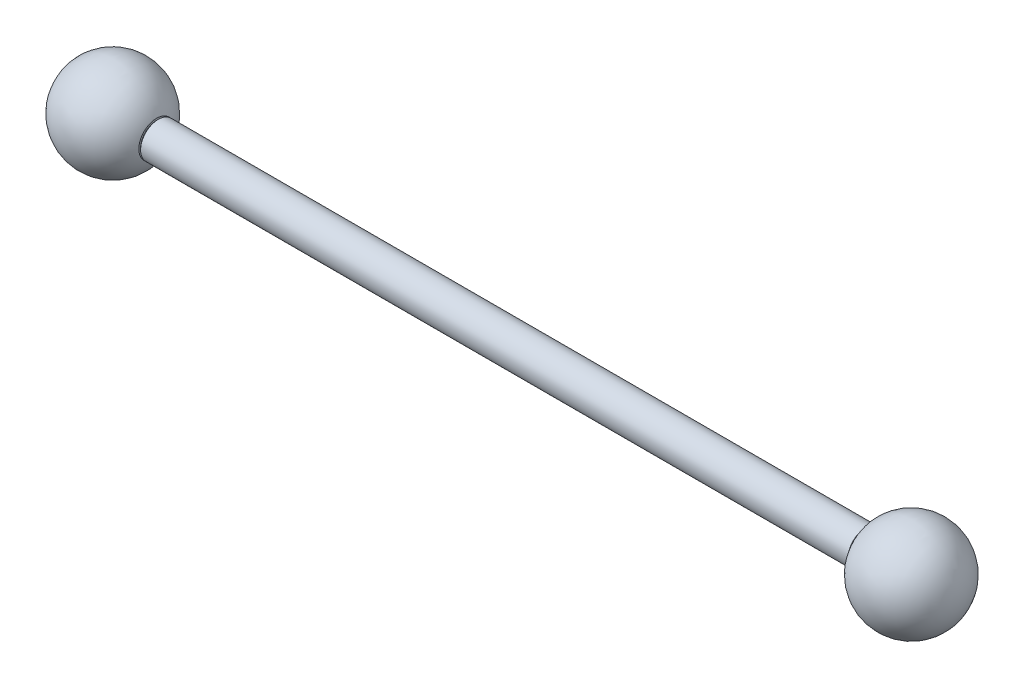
ISO-10303-21;
HEADER;
FILE_DESCRIPTION(('STEP AP214'),'2;1');
FILE_NAME('part.step','',(''),(''),'','','');
FILE_SCHEMA(('AUTOMOTIVE_DESIGN { 1 0 10303 214 1 1 1 1 }'));
ENDSEC;
DATA;
#1=APPLICATION_CONTEXT('core data for automotive mechanical design processes');
#2=APPLICATION_PROTOCOL_DEFINITION('international standard','automotive_design',2000,#1);
#3=PRODUCT_CONTEXT('',#1,'mechanical');
#4=PRODUCT('Part','Part','',(#3));
#5=PRODUCT_RELATED_PRODUCT_CATEGORY('part','',(#4));
#6=PRODUCT_DEFINITION_FORMATION('','',#4);
#7=PRODUCT_DEFINITION_CONTEXT('part definition',#1,'design');
#8=PRODUCT_DEFINITION('design','',#6,#7);
#9=PRODUCT_DEFINITION_SHAPE('','',#8);
#10=(LENGTH_UNIT() NAMED_UNIT(*) SI_UNIT(.MILLI.,.METRE.));
#11=(NAMED_UNIT(*) PLANE_ANGLE_UNIT() SI_UNIT($,.RADIAN.));
#12=(NAMED_UNIT(*) SI_UNIT($,.STERADIAN.) SOLID_ANGLE_UNIT());
#13=UNCERTAINTY_MEASURE_WITH_UNIT(LENGTH_MEASURE(1.E-05),#10,'distance_accuracy_value','');
#14=(GEOMETRIC_REPRESENTATION_CONTEXT(3) GLOBAL_UNCERTAINTY_ASSIGNED_CONTEXT((#13)) GLOBAL_UNIT_ASSIGNED_CONTEXT((#10,
#11,#12)) REPRESENTATION_CONTEXT('',''));
#15=CARTESIAN_POINT('',(0.,0.,0.));
#16=DIRECTION('',(0.,0.,1.));
#17=DIRECTION('',(1.,0.,0.));
#18=AXIS2_PLACEMENT_3D('',#15,#16,#17);
#19=CARTESIAN_POINT('',(33.1491393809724,0.85,0.));
#20=DIRECTION('',(-1.,0.,0.));
#21=DIRECTION('',(0.,-1.,0.));
#22=AXIS2_PLACEMENT_3D('',#19,#20,#21);
#23=PLANE('',#22);
#24=CARTESIAN_POINT('',(33.1491393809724,0.,0.));
#25=DIRECTION('',(-1.,0.,0.));
#26=DIRECTION('',(0.,-1.,0.));
#27=AXIS2_PLACEMENT_3D('',#24,#25,#26);
#28=CIRCLE('',#27,0.849999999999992);
#29=CARTESIAN_POINT('',(33.1491393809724,-0.849999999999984,0.));
#30=VERTEX_POINT('',#29);
#31=EDGE_CURVE('E11',#30,#30,#28,.T.);
#32=ORIENTED_EDGE('',*,*,#31,.F.);
#33=EDGE_LOOP('',(#32));
#34=FACE_BOUND('',#33,.T.);
#35=ADVANCED_FACE('F40',(#34),#23,.F.);
#36=CARTESIAN_POINT('',(33.1491393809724,0.,0.));
#37=DIRECTION('',(-1.,0.,0.));
#38=DIRECTION('',(0.,-1.,0.));
#39=AXIS2_PLACEMENT_3D('',#36,#37,#38);
#40=CONICAL_SURFACE('',#39,0.849999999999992,0.785398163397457);
#41=CARTESIAN_POINT('',(32.9991393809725,0.,0.));
#42=DIRECTION('',(-1.,0.,0.));
#43=DIRECTION('',(0.,-1.,0.));
#44=AXIS2_PLACEMENT_3D('',#41,#42,#43);
#45=CIRCLE('',#44,0.999999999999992);
#46=CARTESIAN_POINT('',(32.9991393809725,-0.999999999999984,0.));
#47=VERTEX_POINT('',#46);
#48=EDGE_CURVE('E46',#47,#47,#45,.T.);
#49=ORIENTED_EDGE('',*,*,#48,.F.);
#50=EDGE_LOOP('',(#49));
#51=FACE_BOUND('',#50,.T.);
#52=ORIENTED_EDGE('',*,*,#31,.T.);
#53=EDGE_LOOP('',(#52));
#54=FACE_BOUND('',#53,.T.);
#55=ADVANCED_FACE('F142',(#51,#54),#40,.T.);
#56=CARTESIAN_POINT('',(-33.1491393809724,0.,0.));
#57=DIRECTION('',(-1.,0.,0.));
#58=DIRECTION('',(0.,-1.,0.));
#59=AXIS2_PLACEMENT_3D('',#56,#57,#58);
#60=CYLINDRICAL_SURFACE('',#59,0.999999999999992);
#61=CARTESIAN_POINT('',(30.1919007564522,0.,0.));
#62=DIRECTION('',(-1.,0.,0.));
#63=DIRECTION('',(0.,-1.,0.));
#64=AXIS2_PLACEMENT_3D('',#61,#62,#63);
#65=CIRCLE('',#64,0.999999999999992);
#66=CARTESIAN_POINT('',(30.1919007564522,-0.999999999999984,0.));
#67=VERTEX_POINT('',#66);
#68=EDGE_CURVE('E50',#67,#67,#65,.T.);
#69=ORIENTED_EDGE('',*,*,#68,.F.);
#70=EDGE_LOOP('',(#69));
#71=FACE_BOUND('',#70,.T.);
#72=ORIENTED_EDGE('',*,*,#48,.T.);
#73=EDGE_LOOP('',(#72));
#74=FACE_BOUND('',#73,.T.);
#75=ADVANCED_FACE('F137',(#71,#74),#60,.T.);
#76=CARTESIAN_POINT('',(30.1919007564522,0.,0.));
#77=DIRECTION('',(-1.,0.,0.));
#78=DIRECTION('',(0.,-1.,0.));
#79=AXIS2_PLACEMENT_3D('',#76,#77,#78);
#80=CONICAL_SURFACE('',#79,0.999999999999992,0.785398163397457);
#81=CARTESIAN_POINT('',(30.0419007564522,0.,0.));
#82=DIRECTION('',(-1.,0.,0.));
#83=DIRECTION('',(0.,-1.,0.));
#84=AXIS2_PLACEMENT_3D('',#81,#82,#83);
#85=CIRCLE('',#84,1.14999999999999);
#86=CARTESIAN_POINT('',(30.0419007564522,-1.14999999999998,0.));
#87=VERTEX_POINT('',#86);
#88=EDGE_CURVE('E54',#87,#87,#85,.T.);
#89=ORIENTED_EDGE('',*,*,#88,.F.);
#90=EDGE_LOOP('',(#89));
#91=FACE_BOUND('',#90,.T.);
#92=ORIENTED_EDGE('',*,*,#68,.T.);
#93=EDGE_LOOP('',(#92));
#94=FACE_BOUND('',#93,.T.);
#95=ADVANCED_FACE('F131',(#91,#94),#80,.T.);
#96=CARTESIAN_POINT('',(30.0419007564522,1.35000000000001,0.));
#97=DIRECTION('',(-1.,0.,0.));
#98=DIRECTION('',(0.,-1.,0.));
#99=AXIS2_PLACEMENT_3D('',#96,#97,#98);
#100=PLANE('',#99);
#101=CARTESIAN_POINT('',(30.0419007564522,0.,0.));
#102=DIRECTION('',(-1.,0.,0.));
#103=DIRECTION('',(0.,-1.,0.));
#104=AXIS2_PLACEMENT_3D('',#101,#102,#103);
#105=CIRCLE('',#104,1.35);
#106=CARTESIAN_POINT('',(30.0419007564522,-1.34999999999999,0.));
#107=VERTEX_POINT('',#106);
#108=EDGE_CURVE('E59',#107,#107,#105,.T.);
#109=ORIENTED_EDGE('',*,*,#108,.F.);
#110=EDGE_LOOP('',(#109));
#111=FACE_BOUND('',#110,.T.);
#112=ORIENTED_EDGE('',*,*,#88,.T.);
#113=EDGE_LOOP('',(#112));
#114=FACE_BOUND('',#113,.T.);
#115=ADVANCED_FACE('F125',(#111,#114),#100,.F.);
#116=CARTESIAN_POINT('',(30.0419007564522,0.,0.));
#117=DIRECTION('',(-1.,0.,0.));
#118=DIRECTION('',(0.,-1.,0.));
#119=AXIS2_PLACEMENT_3D('',#116,#117,#118);
#120=CONICAL_SURFACE('',#119,1.35,0.785398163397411);
#121=CARTESIAN_POINT('',(29.8919007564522,0.,0.));
#122=DIRECTION('',(-1.,0.,0.));
#123=DIRECTION('',(0.,-1.,0.));
#124=AXIS2_PLACEMENT_3D('',#121,#122,#123);
#125=CIRCLE('',#124,1.5);
#126=CARTESIAN_POINT('',(29.8919007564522,-1.49999999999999,0.));
#127=VERTEX_POINT('',#126);
#128=EDGE_CURVE('E62',#127,#127,#125,.T.);
#129=ORIENTED_EDGE('',*,*,#128,.F.);
#130=EDGE_LOOP('',(#129));
#131=FACE_BOUND('',#130,.T.);
#132=ORIENTED_EDGE('',*,*,#108,.T.);
#133=EDGE_LOOP('',(#132));
#134=FACE_BOUND('',#133,.T.);
#135=ADVANCED_FACE('F119',(#131,#134),#120,.T.);
#136=CARTESIAN_POINT('',(-33.1491393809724,0.,0.));
#137=DIRECTION('',(-1.,0.,0.));
#138=DIRECTION('',(0.,-1.,0.));
#139=AXIS2_PLACEMENT_3D('',#136,#137,#138);
#140=CYLINDRICAL_SURFACE('',#139,1.5);
#141=CARTESIAN_POINT('',(-29.8919007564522,0.,0.));
#142=DIRECTION('',(-1.,0.,0.));
#143=DIRECTION('',(0.,-1.,0.));
#144=AXIS2_PLACEMENT_3D('',#141,#142,#143);
#145=CIRCLE('',#144,1.5);
#146=CARTESIAN_POINT('',(-29.8919007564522,-1.5,0.));
#147=VERTEX_POINT('',#146);
#148=EDGE_CURVE('E65',#147,#147,#145,.T.);
#149=ORIENTED_EDGE('',*,*,#148,.F.);
#150=EDGE_LOOP('',(#149));
#151=FACE_BOUND('',#150,.T.);
#152=ORIENTED_EDGE('',*,*,#128,.T.);
#153=EDGE_LOOP('',(#152));
#154=FACE_BOUND('',#153,.T.);
#155=ADVANCED_FACE('F113',(#151,#154),#140,.T.);
#156=CARTESIAN_POINT('',(-29.8919007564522,0.,0.));
#157=DIRECTION('',(1.,0.,0.));
#158=DIRECTION('',(0.,1.,0.));
#159=AXIS2_PLACEMENT_3D('',#156,#157,#158);
#160=CONICAL_SURFACE('',#159,1.5,0.785398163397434);
#161=CARTESIAN_POINT('',(-30.0419007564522,0.,0.));
#162=DIRECTION('',(-1.,0.,0.));
#163=DIRECTION('',(0.,-1.,0.));
#164=AXIS2_PLACEMENT_3D('',#161,#162,#163);
#165=CIRCLE('',#164,1.35);
#166=CARTESIAN_POINT('',(-30.0419007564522,-1.35,0.));
#167=VERTEX_POINT('',#166);
#168=EDGE_CURVE('E68',#167,#167,#165,.T.);
#169=ORIENTED_EDGE('',*,*,#168,.F.);
#170=EDGE_LOOP('',(#169));
#171=FACE_BOUND('',#170,.T.);
#172=ORIENTED_EDGE('',*,*,#148,.T.);
#173=EDGE_LOOP('',(#172));
#174=FACE_BOUND('',#173,.T.);
#175=ADVANCED_FACE('F107',(#171,#174),#160,.T.);
#176=CARTESIAN_POINT('',(-30.0419007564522,1.35,0.));
#177=DIRECTION('',(1.,0.,0.));
#178=DIRECTION('',(0.,1.,0.));
#179=AXIS2_PLACEMENT_3D('',#176,#177,#178);
#180=PLANE('',#179);
#181=CARTESIAN_POINT('',(-30.0419007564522,0.,0.));
#182=DIRECTION('',(-1.,0.,0.));
#183=DIRECTION('',(0.,-1.,0.));
#184=AXIS2_PLACEMENT_3D('',#181,#182,#183);
#185=CIRCLE('',#184,1.15);
#186=CARTESIAN_POINT('',(-30.0419007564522,-1.15,0.));
#187=VERTEX_POINT('',#186);
#188=EDGE_CURVE('E71',#187,#187,#185,.T.);
#189=ORIENTED_EDGE('',*,*,#188,.F.);
#190=EDGE_LOOP('',(#189));
#191=FACE_BOUND('',#190,.T.);
#192=ORIENTED_EDGE('',*,*,#168,.T.);
#193=EDGE_LOOP('',(#192));
#194=FACE_BOUND('',#193,.T.);
#195=ADVANCED_FACE('F101',(#191,#194),#180,.F.);
#196=CARTESIAN_POINT('',(-30.0419007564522,0.,0.));
#197=DIRECTION('',(1.,0.,0.));
#198=DIRECTION('',(0.,1.,0.));
#199=AXIS2_PLACEMENT_3D('',#196,#197,#198);
#200=CONICAL_SURFACE('',#199,1.15,0.785398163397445);
#201=CARTESIAN_POINT('',(-30.1919007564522,0.,0.));
#202=DIRECTION('',(-1.,0.,0.));
#203=DIRECTION('',(0.,-1.,0.));
#204=AXIS2_PLACEMENT_3D('',#201,#202,#203);
#205=CIRCLE('',#204,1.);
#206=CARTESIAN_POINT('',(-30.1919007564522,-0.999999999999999,0.));
#207=VERTEX_POINT('',#206);
#208=EDGE_CURVE('E74',#207,#207,#205,.T.);
#209=ORIENTED_EDGE('',*,*,#208,.F.);
#210=EDGE_LOOP('',(#209));
#211=FACE_BOUND('',#210,.T.);
#212=ORIENTED_EDGE('',*,*,#188,.T.);
#213=EDGE_LOOP('',(#212));
#214=FACE_BOUND('',#213,.T.);
#215=ADVANCED_FACE('F95',(#211,#214),#200,.T.);
#216=CARTESIAN_POINT('',(-33.1491393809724,0.,0.));
#217=DIRECTION('',(-1.,0.,0.));
#218=DIRECTION('',(0.,-1.,0.));
#219=AXIS2_PLACEMENT_3D('',#216,#217,#218);
#220=CYLINDRICAL_SURFACE('',#219,1.);
#221=CARTESIAN_POINT('',(-32.9991393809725,0.,0.));
#222=DIRECTION('',(-1.,0.,0.));
#223=DIRECTION('',(0.,-1.,0.));
#224=AXIS2_PLACEMENT_3D('',#221,#222,#223);
#225=CIRCLE('',#224,1.);
#226=CARTESIAN_POINT('',(-32.9991393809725,-1.,0.));
#227=VERTEX_POINT('',#226);
#228=EDGE_CURVE('E77',#227,#227,#225,.T.);
#229=ORIENTED_EDGE('',*,*,#228,.F.);
#230=EDGE_LOOP('',(#229));
#231=FACE_BOUND('',#230,.T.);
#232=ORIENTED_EDGE('',*,*,#208,.T.);
#233=EDGE_LOOP('',(#232));
#234=FACE_BOUND('',#233,.T.);
#235=ADVANCED_FACE('F89',(#231,#234),#220,.T.);
#236=CARTESIAN_POINT('',(-32.9991393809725,0.,0.));
#237=DIRECTION('',(1.,0.,0.));
#238=DIRECTION('',(0.,1.,0.));
#239=AXIS2_PLACEMENT_3D('',#236,#237,#238);
#240=CONICAL_SURFACE('',#239,1.,0.785398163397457);
#241=CARTESIAN_POINT('',(-33.1491393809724,0.,0.));
#242=DIRECTION('',(-1.,0.,0.));
#243=DIRECTION('',(0.,-1.,0.));
#244=AXIS2_PLACEMENT_3D('',#241,#242,#243);
#245=CIRCLE('',#244,0.85);
#246=CARTESIAN_POINT('',(-33.1491393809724,-0.85,0.));
#247=VERTEX_POINT('',#246);
#248=EDGE_CURVE('E80',#247,#247,#245,.T.);
#249=ORIENTED_EDGE('',*,*,#248,.F.);
#250=EDGE_LOOP('',(#249));
#251=FACE_BOUND('',#250,.T.);
#252=ORIENTED_EDGE('',*,*,#228,.T.);
#253=EDGE_LOOP('',(#252));
#254=FACE_BOUND('',#253,.T.);
#255=ADVANCED_FACE('F86',(#251,#254),#240,.T.);
#256=CARTESIAN_POINT('',(-33.1491393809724,0.85,0.));
#257=DIRECTION('',(1.,0.,0.));
#258=DIRECTION('',(0.,1.,0.));
#259=AXIS2_PLACEMENT_3D('',#256,#257,#258);
#260=PLANE('',#259);
#261=ORIENTED_EDGE('',*,*,#248,.T.);
#262=EDGE_LOOP('',(#261));
#263=FACE_BOUND('',#262,.T.);
#264=ADVANCED_FACE('F84',(#263),#260,.F.);
#265=CLOSED_SHELL('',(#35,#55,#75,#95,#115,#135,#155,#175,#195,#215,#235,#255,#264));
#266=MANIFOLD_SOLID_BREP('B2',#265);
#267=CARTESIAN_POINT('',(33.1491393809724,0.,0.));
#268=DIRECTION('',(-1.,0.,0.));
#269=DIRECTION('',(0.,-1.,0.));
#270=AXIS2_PLACEMENT_3D('',#267,#268,#269);
#271=CONICAL_SURFACE('',#270,0.999999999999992,1.02974425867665);
#272=CARTESIAN_POINT('',(33.75,0.,0.));
#273=VERTEX_POINT('',#272);
#274=VERTEX_LOOP('',#273);
#275=FACE_BOUND('',#274,.T.);
#276=CARTESIAN_POINT('',(33.1491393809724,0.,0.));
#277=DIRECTION('',(-1.,0.,0.));
#278=DIRECTION('',(0.,-1.,0.));
#279=AXIS2_PLACEMENT_3D('',#276,#277,#278);
#280=CIRCLE('',#279,0.999999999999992);
#281=CARTESIAN_POINT('',(33.1491393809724,-0.999999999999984,0.));
#282=VERTEX_POINT('',#281);
#283=EDGE_CURVE('E255',#282,#282,#280,.T.);
#284=ORIENTED_EDGE('',*,*,#283,.T.);
#285=EDGE_LOOP('',(#284));
#286=FACE_BOUND('',#285,.T.);
#287=ADVANCED_FACE('F240',(#275,#286),#271,.F.);
#288=CARTESIAN_POINT('',(-33.75,0.,0.));
#289=DIRECTION('',(-1.,0.,0.));
#290=DIRECTION('',(0.,-1.,0.));
#291=AXIS2_PLACEMENT_3D('',#288,#289,#290);
#292=CYLINDRICAL_SURFACE('',#291,0.999999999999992);
#293=CARTESIAN_POINT('',(30.1919007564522,0.,0.));
#294=DIRECTION('',(1.,0.,0.));
#295=DIRECTION('',(0.,1.,0.));
#296=AXIS2_PLACEMENT_3D('',#293,#294,#295);
#297=CIRCLE('',#296,0.999999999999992);
#298=CARTESIAN_POINT('',(30.1919007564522,1.,0.));
#299=VERTEX_POINT('',#298);
#300=EDGE_CURVE('E247',#299,#299,#297,.F.);
#301=ORIENTED_EDGE('',*,*,#300,.T.);
#302=EDGE_LOOP('',(#301));
#303=FACE_BOUND('',#302,.T.);
#304=ORIENTED_EDGE('',*,*,#283,.F.);
#305=EDGE_LOOP('',(#304));
#306=FACE_BOUND('',#305,.T.);
#307=ADVANCED_FACE('F252',(#303,#306),#292,.F.);
#308=CARTESIAN_POINT('',(30.0419007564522,1.50000000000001,0.));
#309=DIRECTION('',(1.,0.,0.));
#310=DIRECTION('',(0.,1.,0.));
#311=AXIS2_PLACEMENT_3D('',#308,#309,#310);
#312=PLANE('',#311);
#313=CARTESIAN_POINT('',(30.0419007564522,0.,0.));
#314=DIRECTION('',(1.,0.,0.));
#315=DIRECTION('',(0.,1.,0.));
#316=AXIS2_PLACEMENT_3D('',#313,#314,#315);
#317=CIRCLE('',#316,1.14999999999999);
#318=CARTESIAN_POINT('',(30.0419007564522,1.15,0.));
#319=VERTEX_POINT('',#318);
#320=EDGE_CURVE('E38',#319,#319,#317,.T.);
#321=ORIENTED_EDGE('',*,*,#320,.T.);
#322=EDGE_LOOP('',(#321));
#323=FACE_BOUND('',#322,.T.);
#324=CARTESIAN_POINT('',(30.0419007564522,0.,0.));
#325=DIRECTION('',(-1.,0.,0.));
#326=DIRECTION('',(0.,-1.,0.));
#327=AXIS2_PLACEMENT_3D('',#324,#325,#326);
#328=CIRCLE('',#327,1.5);
#329=CARTESIAN_POINT('',(30.0419007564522,-1.49999999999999,0.));
#330=VERTEX_POINT('',#329);
#331=EDGE_CURVE('E257',#330,#330,#328,.T.);
#332=ORIENTED_EDGE('',*,*,#331,.T.);
#333=EDGE_LOOP('',(#332));
#334=FACE_BOUND('',#333,.T.);
#335=ADVANCED_FACE('F264',(#323,#334),#312,.F.);
#336=CARTESIAN_POINT('',(33.75,0.,0.));
#337=DIRECTION('',(-1.,0.,0.));
#338=DIRECTION('',(0.,1.,0.));
#339=AXIS2_PLACEMENT_3D('',#336,#337,#338);
#340=SPHERICAL_SURFACE('',#339,4.);
#341=ORIENTED_EDGE('',*,*,#331,.F.);
#342=EDGE_LOOP('',(#341));
#343=FACE_BOUND('',#342,.T.);
#344=ADVANCED_FACE('F266',(#343),#340,.T.);
#345=CARTESIAN_POINT('',(30.1919007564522,0.,0.));
#346=DIRECTION('',(-1.,0.,0.));
#347=DIRECTION('',(0.,-1.,0.));
#348=AXIS2_PLACEMENT_3D('',#345,#346,#347);
#349=CONICAL_SURFACE('',#348,0.999999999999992,0.785398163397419);
#350=ORIENTED_EDGE('',*,*,#320,.F.);
#351=EDGE_LOOP('',(#350));
#352=FACE_BOUND('',#351,.T.);
#353=ORIENTED_EDGE('',*,*,#300,.F.);
#354=EDGE_LOOP('',(#353));
#355=FACE_BOUND('',#354,.T.);
#356=ADVANCED_FACE('F242',(#352,#355),#349,.F.);
#357=CLOSED_SHELL('',(#287,#307,#335,#344,#356));
#358=MANIFOLD_SOLID_BREP('B6',#357);
#359=CARTESIAN_POINT('',(-33.75,0.,0.));
#360=DIRECTION('',(1.,0.,0.));
#361=DIRECTION('',(0.,1.,0.));
#362=AXIS2_PLACEMENT_3D('',#359,#360,#361);
#363=CONICAL_SURFACE('',#362,0.,1.02974425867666);
#364=CARTESIAN_POINT('',(-33.1491393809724,0.,0.));
#365=DIRECTION('',(-1.,0.,0.));
#366=DIRECTION('',(0.,-1.,0.));
#367=AXIS2_PLACEMENT_3D('',#364,#365,#366);
#368=CIRCLE('',#367,1.);
#369=CARTESIAN_POINT('',(-33.1491393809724,-1.,0.));
#370=VERTEX_POINT('',#369);
#371=EDGE_CURVE('E348',#370,#370,#368,.T.);
#372=ORIENTED_EDGE('',*,*,#371,.F.);
#373=EDGE_LOOP('',(#372));
#374=FACE_BOUND('',#373,.T.);
#375=CARTESIAN_POINT('',(-33.75,0.,0.));
#376=VERTEX_POINT('',#375);
#377=VERTEX_LOOP('',#376);
#378=FACE_BOUND('',#377,.T.);
#379=ADVANCED_FACE('F313',(#374,#378),#363,.F.);
#380=CARTESIAN_POINT('',(-33.75,0.,0.));
#381=DIRECTION('',(-1.,0.,0.));
#382=DIRECTION('',(0.,-1.,0.));
#383=AXIS2_PLACEMENT_3D('',#380,#381,#382);
#384=CYLINDRICAL_SURFACE('',#383,1.);
#385=CARTESIAN_POINT('',(-30.1919007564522,0.,0.));
#386=DIRECTION('',(-1.,0.,0.));
#387=DIRECTION('',(0.,-1.,0.));
#388=AXIS2_PLACEMENT_3D('',#385,#386,#387);
#389=CIRCLE('',#388,1.);
#390=CARTESIAN_POINT('',(-30.1919007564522,-0.999999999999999,0.));
#391=VERTEX_POINT('',#390);
#392=EDGE_CURVE('E238',#391,#391,#389,.F.);
#393=ORIENTED_EDGE('',*,*,#392,.T.);
#394=EDGE_LOOP('',(#393));
#395=FACE_BOUND('',#394,.T.);
#396=ORIENTED_EDGE('',*,*,#371,.T.);
#397=EDGE_LOOP('',(#396));
#398=FACE_BOUND('',#397,.T.);
#399=ADVANCED_FACE('F324',(#395,#398),#384,.F.);
#400=CARTESIAN_POINT('',(-30.0419007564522,1.5,0.));
#401=DIRECTION('',(-1.,0.,0.));
#402=DIRECTION('',(0.,-1.,0.));
#403=AXIS2_PLACEMENT_3D('',#400,#401,#402);
#404=PLANE('',#403);
#405=CARTESIAN_POINT('',(-30.0419007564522,0.,0.));
#406=DIRECTION('',(-1.,0.,0.));
#407=DIRECTION('',(0.,-1.,0.));
#408=AXIS2_PLACEMENT_3D('',#405,#406,#407);
#409=CIRCLE('',#408,1.15000000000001);
#410=CARTESIAN_POINT('',(-30.0419007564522,-1.15000000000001,0.));
#411=VERTEX_POINT('',#410);
#412=EDGE_CURVE('E320',#411,#411,#409,.T.);
#413=ORIENTED_EDGE('',*,*,#412,.T.);
#414=EDGE_LOOP('',(#413));
#415=FACE_BOUND('',#414,.T.);
#416=CARTESIAN_POINT('',(-30.0419007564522,0.,0.));
#417=DIRECTION('',(-1.,0.,0.));
#418=DIRECTION('',(0.,-1.,0.));
#419=AXIS2_PLACEMENT_3D('',#416,#417,#418);
#420=CIRCLE('',#419,1.5);
#421=CARTESIAN_POINT('',(-30.0419007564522,-1.5,0.));
#422=VERTEX_POINT('',#421);
#423=EDGE_CURVE('E346',#422,#422,#420,.T.);
#424=ORIENTED_EDGE('',*,*,#423,.F.);
#425=EDGE_LOOP('',(#424));
#426=FACE_BOUND('',#425,.T.);
#427=ADVANCED_FACE('F329',(#415,#426),#404,.F.);
#428=CARTESIAN_POINT('',(-33.75,0.,0.));
#429=DIRECTION('',(-1.,0.,0.));
#430=DIRECTION('',(0.,1.,0.));
#431=AXIS2_PLACEMENT_3D('',#428,#429,#430);
#432=SPHERICAL_SURFACE('',#431,4.);
#433=ORIENTED_EDGE('',*,*,#423,.T.);
#434=EDGE_LOOP('',(#433));
#435=FACE_BOUND('',#434,.T.);
#436=ADVANCED_FACE('F336',(#435),#432,.T.);
#437=CARTESIAN_POINT('',(-30.0419007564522,0.,0.));
#438=DIRECTION('',(1.,0.,0.));
#439=DIRECTION('',(0.,1.,0.));
#440=AXIS2_PLACEMENT_3D('',#437,#438,#439);
#441=CONICAL_SURFACE('',#440,1.15000000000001,0.78539816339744);
#442=ORIENTED_EDGE('',*,*,#392,.F.);
#443=EDGE_LOOP('',(#442));
#444=FACE_BOUND('',#443,.T.);
#445=ORIENTED_EDGE('',*,*,#412,.F.);
#446=EDGE_LOOP('',(#445));
#447=FACE_BOUND('',#446,.T.);
#448=ADVANCED_FACE('F315',(#444,#447),#441,.F.);
#449=CLOSED_SHELL('',(#379,#399,#427,#436,#448));
#450=MANIFOLD_SOLID_BREP('B32',#449);
#451=ADVANCED_BREP_SHAPE_REPRESENTATION('',(#18,#266,#358,#450),#14);
#452=SHAPE_DEFINITION_REPRESENTATION(#9,#451);
ENDSEC;
END-ISO-10303-21;
